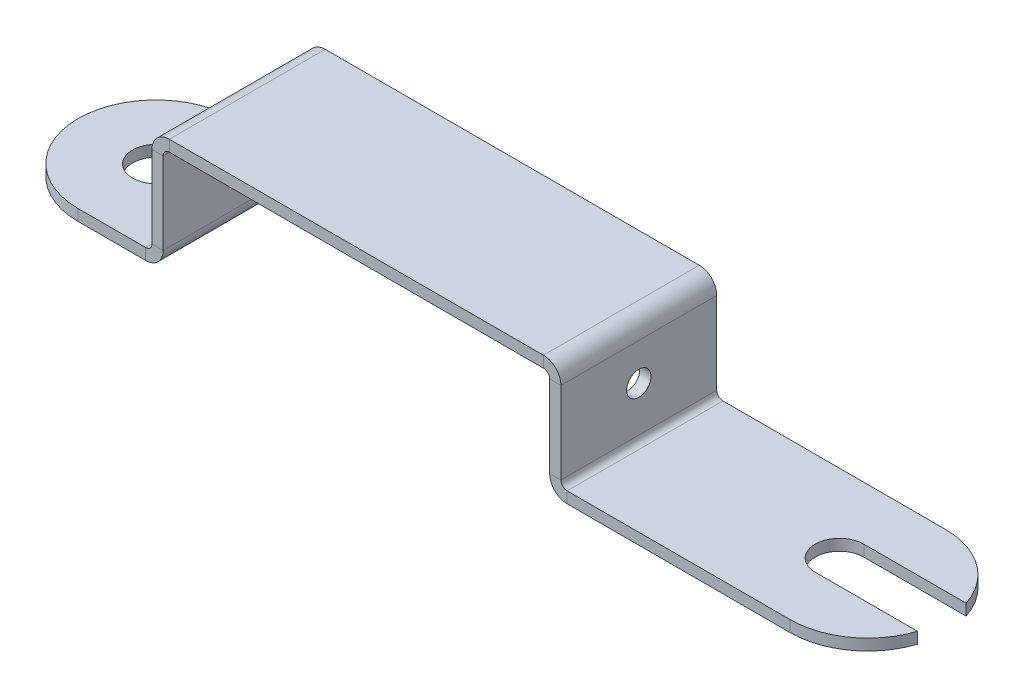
ISO-10303-21;
HEADER;
FILE_DESCRIPTION(('STEP AP214'),'2;1');
FILE_NAME('part.step','',(''),(''),'','','');
FILE_SCHEMA(('AUTOMOTIVE_DESIGN { 1 0 10303 214 1 1 1 1 }'));
ENDSEC;
DATA;
#1=APPLICATION_CONTEXT('core data for automotive mechanical design processes');
#2=APPLICATION_PROTOCOL_DEFINITION('international standard','automotive_design',2000,#1);
#3=PRODUCT_CONTEXT('',#1,'mechanical');
#4=PRODUCT('Part','Part','',(#3));
#5=PRODUCT_RELATED_PRODUCT_CATEGORY('part','',(#4));
#6=PRODUCT_DEFINITION_FORMATION('','',#4);
#7=PRODUCT_DEFINITION_CONTEXT('part definition',#1,'design');
#8=PRODUCT_DEFINITION('design','',#6,#7);
#9=PRODUCT_DEFINITION_SHAPE('','',#8);
#10=(LENGTH_UNIT() NAMED_UNIT(*) SI_UNIT(.MILLI.,.METRE.));
#11=(NAMED_UNIT(*) PLANE_ANGLE_UNIT() SI_UNIT($,.RADIAN.));
#12=(NAMED_UNIT(*) SI_UNIT($,.STERADIAN.) SOLID_ANGLE_UNIT());
#13=UNCERTAINTY_MEASURE_WITH_UNIT(LENGTH_MEASURE(1.E-05),#10,'distance_accuracy_value','');
#14=(GEOMETRIC_REPRESENTATION_CONTEXT(3) GLOBAL_UNCERTAINTY_ASSIGNED_CONTEXT((#13)) GLOBAL_UNIT_ASSIGNED_CONTEXT((#10,
#11,#12)) REPRESENTATION_CONTEXT('',''));
#15=CARTESIAN_POINT('',(0.,0.,0.));
#16=DIRECTION('',(0.,0.,1.));
#17=DIRECTION('',(1.,0.,0.));
#18=AXIS2_PLACEMENT_3D('',#15,#16,#17);
#19=CARTESIAN_POINT('',(5.9436,0.508,6.35));
#20=DIRECTION('',(0.,0.,1.));
#21=DIRECTION('',(1.,0.,0.));
#22=AXIS2_PLACEMENT_3D('',#19,#20,#21);
#23=PLANE('',#22);
#24=DIRECTION('',(1.,0.,0.));
#25=VECTOR('',#24,1.);
#26=CARTESIAN_POINT('',(5.9436,0.508,6.35));
#27=LINE('',#26,#25);
#28=CARTESIAN_POINT('',(5.9436,0.508,6.35));
#29=VERTEX_POINT('',#28);
#30=CARTESIAN_POINT('',(6.858,0.508,6.35));
#31=VERTEX_POINT('',#30);
#32=EDGE_CURVE('E429',#29,#31,#27,.T.);
#33=ORIENTED_EDGE('',*,*,#32,.F.);
#34=CARTESIAN_POINT('',(5.4356,0.508,6.35));
#35=DIRECTION('',(0.,0.,-1.));
#36=DIRECTION('',(-1.,0.,0.));
#37=AXIS2_PLACEMENT_3D('',#34,#35,#36);
#38=CIRCLE('',#37,0.508);
#39=CARTESIAN_POINT('',(5.4356,0.,6.35));
#40=VERTEX_POINT('',#39);
#41=EDGE_CURVE('E270',#40,#29,#38,.F.);
#42=ORIENTED_EDGE('',*,*,#41,.F.);
#43=DIRECTION('',(0.,1.,0.));
#44=VECTOR('',#43,1.);
#45=CARTESIAN_POINT('',(5.4356,-0.9144,6.35));
#46=LINE('',#45,#44);
#47=CARTESIAN_POINT('',(5.4356,-0.9144,6.35));
#48=VERTEX_POINT('',#47);
#49=EDGE_CURVE('E426',#48,#40,#46,.T.);
#50=ORIENTED_EDGE('',*,*,#49,.F.);
#51=CARTESIAN_POINT('',(5.4356,0.508,6.35));
#52=DIRECTION('',(0.,0.,1.));
#53=DIRECTION('',(1.,0.,0.));
#54=AXIS2_PLACEMENT_3D('',#51,#52,#53);
#55=CIRCLE('',#54,1.4224);
#56=EDGE_CURVE('E277',#48,#31,#55,.T.);
#57=ORIENTED_EDGE('',*,*,#56,.T.);
#58=EDGE_LOOP('',(#33,#42,#50,#57));
#59=FACE_BOUND('',#58,.T.);
#60=ADVANCED_FACE('F37',(#59),#23,.T.);
#61=CARTESIAN_POINT('',(5.4356,-0.9144,6.35));
#62=DIRECTION('',(0.,0.,1.));
#63=DIRECTION('',(1.,0.,0.));
#64=AXIS2_PLACEMENT_3D('',#61,#62,#63);
#65=PLANE('',#64);
#66=DIRECTION('',(0.,1.,0.));
#67=VECTOR('',#66,1.);
#68=CARTESIAN_POINT('',(5.9436,0.,6.35));
#69=LINE('',#68,#67);
#70=CARTESIAN_POINT('',(5.9436,7.1882,6.35));
#71=VERTEX_POINT('',#70);
#72=EDGE_CURVE('E267',#29,#71,#69,.T.);
#73=ORIENTED_EDGE('',*,*,#72,.F.);
#74=ORIENTED_EDGE('',*,*,#32,.T.);
#75=DIRECTION('',(0.,1.,0.));
#76=VECTOR('',#75,1.);
#77=CARTESIAN_POINT('',(6.858,0.,6.35));
#78=LINE('',#77,#76);
#79=CARTESIAN_POINT('',(6.858,7.1882,6.35));
#80=VERTEX_POINT('',#79);
#81=EDGE_CURVE('E280',#31,#80,#78,.T.);
#82=ORIENTED_EDGE('',*,*,#81,.T.);
#83=DIRECTION('',(-1.,0.,0.));
#84=VECTOR('',#83,1.);
#85=CARTESIAN_POINT('',(6.858,7.1882,6.35));
#86=LINE('',#85,#84);
#87=EDGE_CURVE('E417',#80,#71,#86,.T.);
#88=ORIENTED_EDGE('',*,*,#87,.T.);
#89=EDGE_LOOP('',(#73,#74,#82,#88));
#90=FACE_BOUND('',#89,.T.);
#91=ADVANCED_FACE('F503',(#90),#65,.T.);
#92=CARTESIAN_POINT('',(5.4356,0.,-6.35));
#93=DIRECTION('',(0.,0.,-1.));
#94=DIRECTION('',(-1.,0.,0.));
#95=AXIS2_PLACEMENT_3D('',#92,#93,#94);
#96=PLANE('',#95);
#97=DIRECTION('',(0.,-1.,0.));
#98=VECTOR('',#97,1.);
#99=CARTESIAN_POINT('',(5.4356,0.,-6.35));
#100=LINE('',#99,#98);
#101=CARTESIAN_POINT('',(5.4356,0.,-6.35));
#102=VERTEX_POINT('',#101);
#103=CARTESIAN_POINT('',(5.4356,-0.9144,-6.35));
#104=VERTEX_POINT('',#103);
#105=EDGE_CURVE('E423',#102,#104,#100,.T.);
#106=ORIENTED_EDGE('',*,*,#105,.F.);
#107=CARTESIAN_POINT('',(5.4356,0.508,-6.35));
#108=DIRECTION('',(0.,0.,-1.));
#109=DIRECTION('',(-1.,0.,0.));
#110=AXIS2_PLACEMENT_3D('',#107,#108,#109);
#111=CIRCLE('',#110,0.508);
#112=CARTESIAN_POINT('',(5.9436,0.508,-6.35));
#113=VERTEX_POINT('',#112);
#114=EDGE_CURVE('E323',#102,#113,#111,.F.);
#115=ORIENTED_EDGE('',*,*,#114,.T.);
#116=DIRECTION('',(-1.,0.,0.));
#117=VECTOR('',#116,1.);
#118=CARTESIAN_POINT('',(6.858,0.508,-6.35));
#119=LINE('',#118,#117);
#120=CARTESIAN_POINT('',(6.858,0.508,-6.35));
#121=VERTEX_POINT('',#120);
#122=EDGE_CURVE('E421',#121,#113,#119,.T.);
#123=ORIENTED_EDGE('',*,*,#122,.F.);
#124=CARTESIAN_POINT('',(5.4356,0.508,-6.35));
#125=DIRECTION('',(0.,0.,1.));
#126=DIRECTION('',(1.,0.,0.));
#127=AXIS2_PLACEMENT_3D('',#124,#125,#126);
#128=CIRCLE('',#127,1.4224);
#129=EDGE_CURVE('E330',#104,#121,#128,.T.);
#130=ORIENTED_EDGE('',*,*,#129,.F.);
#131=EDGE_LOOP('',(#106,#115,#123,#130));
#132=FACE_BOUND('',#131,.T.);
#133=ADVANCED_FACE('F509',(#132),#96,.T.);
#134=CARTESIAN_POINT('',(6.858,0.508,-6.35));
#135=DIRECTION('',(0.,0.,-1.));
#136=DIRECTION('',(-1.,0.,0.));
#137=AXIS2_PLACEMENT_3D('',#134,#135,#136);
#138=PLANE('',#137);
#139=DIRECTION('',(1.,0.,0.));
#140=VECTOR('',#139,1.);
#141=CARTESIAN_POINT('',(-6.4262,-0.9144,-6.35));
#142=LINE('',#141,#140);
#143=CARTESIAN_POINT('',(-0.0762000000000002,-0.9144,-6.35));
#144=VERTEX_POINT('',#143);
#145=EDGE_CURVE('E328',#144,#104,#142,.T.);
#146=ORIENTED_EDGE('',*,*,#145,.F.);
#147=DIRECTION('',(0.,1.,0.));
#148=VECTOR('',#147,1.);
#149=CARTESIAN_POINT('',(-0.0762000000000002,0.508,-6.35));
#150=LINE('',#149,#148);
#151=CARTESIAN_POINT('',(-0.0762000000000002,0.,-6.35));
#152=VERTEX_POINT('',#151);
#153=EDGE_CURVE('E445',#144,#152,#150,.T.);
#154=ORIENTED_EDGE('',*,*,#153,.T.);
#155=DIRECTION('',(1.,0.,0.));
#156=VECTOR('',#155,1.);
#157=CARTESIAN_POINT('',(-6.4262,0.,-6.35));
#158=LINE('',#157,#156);
#159=EDGE_CURVE('E326',#152,#102,#158,.T.);
#160=ORIENTED_EDGE('',*,*,#159,.T.);
#161=ORIENTED_EDGE('',*,*,#105,.T.);
#162=EDGE_LOOP('',(#146,#154,#160,#161));
#163=FACE_BOUND('',#162,.T.);
#164=ADVANCED_FACE('F515',(#163),#138,.T.);
#165=CARTESIAN_POINT('',(7.366,8.6106,6.35));
#166=DIRECTION('',(0.,0.,1.));
#167=DIRECTION('',(1.,0.,0.));
#168=AXIS2_PLACEMENT_3D('',#165,#166,#167);
#169=PLANE('',#168);
#170=DIRECTION('',(0.,-1.,0.));
#171=VECTOR('',#170,1.);
#172=CARTESIAN_POINT('',(7.366,8.6106,6.35));
#173=LINE('',#172,#171);
#174=CARTESIAN_POINT('',(7.366,8.6106,6.35));
#175=VERTEX_POINT('',#174);
#176=CARTESIAN_POINT('',(7.366,7.6962,6.35));
#177=VERTEX_POINT('',#176);
#178=EDGE_CURVE('E419',#175,#177,#173,.T.);
#179=ORIENTED_EDGE('',*,*,#178,.F.);
#180=CARTESIAN_POINT('',(7.366,7.1882,6.35));
#181=DIRECTION('',(0.,0.,1.));
#182=DIRECTION('',(1.,0.,0.));
#183=AXIS2_PLACEMENT_3D('',#180,#181,#182);
#184=CIRCLE('',#183,1.4224);
#185=EDGE_CURVE('E264',#71,#175,#184,.F.);
#186=ORIENTED_EDGE('',*,*,#185,.F.);
#187=ORIENTED_EDGE('',*,*,#87,.F.);
#188=CARTESIAN_POINT('',(7.366,7.1882,6.35));
#189=DIRECTION('',(0.,0.,1.));
#190=DIRECTION('',(1.,0.,0.));
#191=AXIS2_PLACEMENT_3D('',#188,#189,#190);
#192=CIRCLE('',#191,0.508);
#193=EDGE_CURVE('E283',#80,#177,#192,.F.);
#194=ORIENTED_EDGE('',*,*,#193,.T.);
#195=EDGE_LOOP('',(#179,#186,#187,#194));
#196=FACE_BOUND('',#195,.T.);
#197=ADVANCED_FACE('F519',(#196),#169,.T.);
#198=CARTESIAN_POINT('',(6.858,7.1882,6.35));
#199=DIRECTION('',(0.,0.,1.));
#200=DIRECTION('',(1.,0.,0.));
#201=AXIS2_PLACEMENT_3D('',#198,#199,#200);
#202=PLANE('',#201);
#203=DIRECTION('',(1.,0.,0.));
#204=VECTOR('',#203,1.);
#205=CARTESIAN_POINT('',(5.9436,8.6106,6.35));
#206=LINE('',#205,#204);
#207=CARTESIAN_POINT('',(37.8587,8.6106,6.35));
#208=VERTEX_POINT('',#207);
#209=EDGE_CURVE('E261',#175,#208,#206,.T.);
#210=ORIENTED_EDGE('',*,*,#209,.F.);
#211=ORIENTED_EDGE('',*,*,#178,.T.);
#212=DIRECTION('',(1.,0.,0.));
#213=VECTOR('',#212,1.);
#214=CARTESIAN_POINT('',(5.9436,7.6962,6.35));
#215=LINE('',#214,#213);
#216=CARTESIAN_POINT('',(37.8587,7.6962,6.35));
#217=VERTEX_POINT('',#216);
#218=EDGE_CURVE('E286',#177,#217,#215,.T.);
#219=ORIENTED_EDGE('',*,*,#218,.T.);
#220=DIRECTION('',(0.,1.,0.));
#221=VECTOR('',#220,1.);
#222=CARTESIAN_POINT('',(37.8587,7.6962,6.35));
#223=LINE('',#222,#221);
#224=EDGE_CURVE('E409',#217,#208,#223,.T.);
#225=ORIENTED_EDGE('',*,*,#224,.T.);
#226=EDGE_LOOP('',(#210,#211,#219,#225));
#227=FACE_BOUND('',#226,.T.);
#228=ADVANCED_FACE('F523',(#227),#202,.T.);
#229=CARTESIAN_POINT('',(5.9436,7.1882,-6.35));
#230=DIRECTION('',(0.,0.,-1.));
#231=DIRECTION('',(-1.,0.,0.));
#232=AXIS2_PLACEMENT_3D('',#229,#230,#231);
#233=PLANE('',#232);
#234=DIRECTION('',(1.,0.,0.));
#235=VECTOR('',#234,1.);
#236=CARTESIAN_POINT('',(5.9436,7.1882,-6.35));
#237=LINE('',#236,#235);
#238=CARTESIAN_POINT('',(5.9436,7.1882,-6.35));
#239=VERTEX_POINT('',#238);
#240=CARTESIAN_POINT('',(6.858,7.1882,-6.35));
#241=VERTEX_POINT('',#240);
#242=EDGE_CURVE('E415',#239,#241,#237,.T.);
#243=ORIENTED_EDGE('',*,*,#242,.F.);
#244=CARTESIAN_POINT('',(7.366,7.1882,-6.35));
#245=DIRECTION('',(0.,0.,1.));
#246=DIRECTION('',(1.,0.,0.));
#247=AXIS2_PLACEMENT_3D('',#244,#245,#246);
#248=CIRCLE('',#247,1.4224);
#249=CARTESIAN_POINT('',(7.366,8.6106,-6.35));
#250=VERTEX_POINT('',#249);
#251=EDGE_CURVE('E317',#239,#250,#248,.F.);
#252=ORIENTED_EDGE('',*,*,#251,.T.);
#253=DIRECTION('',(0.,1.,0.));
#254=VECTOR('',#253,1.);
#255=CARTESIAN_POINT('',(7.366,7.6962,-6.35));
#256=LINE('',#255,#254);
#257=CARTESIAN_POINT('',(7.366,7.6962,-6.35));
#258=VERTEX_POINT('',#257);
#259=EDGE_CURVE('E413',#258,#250,#256,.T.);
#260=ORIENTED_EDGE('',*,*,#259,.F.);
#261=CARTESIAN_POINT('',(7.366,7.1882,-6.35));
#262=DIRECTION('',(0.,0.,1.));
#263=DIRECTION('',(1.,0.,0.));
#264=AXIS2_PLACEMENT_3D('',#261,#262,#263);
#265=CIRCLE('',#264,0.508);
#266=EDGE_CURVE('E336',#241,#258,#265,.F.);
#267=ORIENTED_EDGE('',*,*,#266,.F.);
#268=EDGE_LOOP('',(#243,#252,#260,#267));
#269=FACE_BOUND('',#268,.T.);
#270=ADVANCED_FACE('F527',(#269),#233,.T.);
#271=CARTESIAN_POINT('',(7.366,7.6962,-6.35));
#272=DIRECTION('',(0.,0.,-1.));
#273=DIRECTION('',(-1.,0.,0.));
#274=AXIS2_PLACEMENT_3D('',#271,#272,#273);
#275=PLANE('',#274);
#276=DIRECTION('',(0.,1.,0.));
#277=VECTOR('',#276,1.);
#278=CARTESIAN_POINT('',(5.9436,0.,-6.35));
#279=LINE('',#278,#277);
#280=EDGE_CURVE('E320',#113,#239,#279,.T.);
#281=ORIENTED_EDGE('',*,*,#280,.T.);
#282=ORIENTED_EDGE('',*,*,#242,.T.);
#283=DIRECTION('',(0.,1.,0.));
#284=VECTOR('',#283,1.);
#285=CARTESIAN_POINT('',(6.858,0.,-6.35));
#286=LINE('',#285,#284);
#287=EDGE_CURVE('E333',#121,#241,#286,.T.);
#288=ORIENTED_EDGE('',*,*,#287,.F.);
#289=ORIENTED_EDGE('',*,*,#122,.T.);
#290=EDGE_LOOP('',(#281,#282,#288,#289));
#291=FACE_BOUND('',#290,.T.);
#292=ADVANCED_FACE('F531',(#291),#275,.T.);
#293=CARTESIAN_POINT('',(39.2811,7.1882,6.35));
#294=DIRECTION('',(0.,0.,1.));
#295=DIRECTION('',(1.,0.,0.));
#296=AXIS2_PLACEMENT_3D('',#293,#294,#295);
#297=PLANE('',#296);
#298=DIRECTION('',(-1.,0.,0.));
#299=VECTOR('',#298,1.);
#300=CARTESIAN_POINT('',(39.2811,7.1882,6.35));
#301=LINE('',#300,#299);
#302=CARTESIAN_POINT('',(39.2811,7.1882,6.35));
#303=VERTEX_POINT('',#302);
#304=CARTESIAN_POINT('',(38.3667,7.1882,6.35));
#305=VERTEX_POINT('',#304);
#306=EDGE_CURVE('E411',#303,#305,#301,.T.);
#307=ORIENTED_EDGE('',*,*,#306,.F.);
#308=CARTESIAN_POINT('',(37.8587,7.1882,6.35));
#309=DIRECTION('',(0.,0.,1.));
#310=DIRECTION('',(1.,0.,0.));
#311=AXIS2_PLACEMENT_3D('',#308,#309,#310);
#312=CIRCLE('',#311,1.4224);
#313=EDGE_CURVE('E258',#208,#303,#312,.F.);
#314=ORIENTED_EDGE('',*,*,#313,.F.);
#315=ORIENTED_EDGE('',*,*,#224,.F.);
#316=CARTESIAN_POINT('',(37.8587,7.1882,6.35));
#317=DIRECTION('',(0.,0.,1.));
#318=DIRECTION('',(1.,0.,0.));
#319=AXIS2_PLACEMENT_3D('',#316,#317,#318);
#320=CIRCLE('',#319,0.508);
#321=EDGE_CURVE('E289',#217,#305,#320,.F.);
#322=ORIENTED_EDGE('',*,*,#321,.T.);
#323=EDGE_LOOP('',(#307,#314,#315,#322));
#324=FACE_BOUND('',#323,.T.);
#325=ADVANCED_FACE('F535',(#324),#297,.T.);
#326=CARTESIAN_POINT('',(37.8587,7.6962,6.35));
#327=DIRECTION('',(0.,0.,1.));
#328=DIRECTION('',(1.,0.,0.));
#329=AXIS2_PLACEMENT_3D('',#326,#327,#328);
#330=PLANE('',#329);
#331=DIRECTION('',(0.,-1.,0.));
#332=VECTOR('',#331,1.);
#333=CARTESIAN_POINT('',(39.2811,8.6106,6.35));
#334=LINE('',#333,#332);
#335=CARTESIAN_POINT('',(39.2811,0.508,6.35));
#336=VERTEX_POINT('',#335);
#337=EDGE_CURVE('E255',#303,#336,#334,.T.);
#338=ORIENTED_EDGE('',*,*,#337,.F.);
#339=ORIENTED_EDGE('',*,*,#306,.T.);
#340=DIRECTION('',(0.,1.,0.));
#341=VECTOR('',#340,1.);
#342=CARTESIAN_POINT('',(38.3667,8.6106,6.35));
#343=LINE('',#342,#341);
#344=CARTESIAN_POINT('',(38.3667,0.508,6.35));
#345=VERTEX_POINT('',#344);
#346=EDGE_CURVE('E292',#305,#345,#343,.F.);
#347=ORIENTED_EDGE('',*,*,#346,.T.);
#348=DIRECTION('',(1.,0.,0.));
#349=VECTOR('',#348,1.);
#350=CARTESIAN_POINT('',(38.3667,0.508,6.35));
#351=LINE('',#350,#349);
#352=EDGE_CURVE('E401',#345,#336,#351,.T.);
#353=ORIENTED_EDGE('',*,*,#352,.T.);
#354=EDGE_LOOP('',(#338,#339,#347,#353));
#355=FACE_BOUND('',#354,.T.);
#356=ADVANCED_FACE('F539',(#355),#330,.T.);
#357=CARTESIAN_POINT('',(37.8587,8.6106,-6.35));
#358=DIRECTION('',(0.,0.,-1.));
#359=DIRECTION('',(-1.,0.,0.));
#360=AXIS2_PLACEMENT_3D('',#357,#358,#359);
#361=PLANE('',#360);
#362=DIRECTION('',(0.,-1.,0.));
#363=VECTOR('',#362,1.);
#364=CARTESIAN_POINT('',(37.8587,8.6106,-6.35));
#365=LINE('',#364,#363);
#366=CARTESIAN_POINT('',(37.8587,8.6106,-6.35));
#367=VERTEX_POINT('',#366);
#368=CARTESIAN_POINT('',(37.8587,7.6962,-6.35));
#369=VERTEX_POINT('',#368);
#370=EDGE_CURVE('E407',#367,#369,#365,.T.);
#371=ORIENTED_EDGE('',*,*,#370,.F.);
#372=CARTESIAN_POINT('',(37.8587,7.1882,-6.35));
#373=DIRECTION('',(0.,0.,1.));
#374=DIRECTION('',(1.,0.,0.));
#375=AXIS2_PLACEMENT_3D('',#372,#373,#374);
#376=CIRCLE('',#375,1.4224);
#377=CARTESIAN_POINT('',(39.2811,7.1882,-6.35));
#378=VERTEX_POINT('',#377);
#379=EDGE_CURVE('E311',#367,#378,#376,.F.);
#380=ORIENTED_EDGE('',*,*,#379,.T.);
#381=DIRECTION('',(1.,0.,0.));
#382=VECTOR('',#381,1.);
#383=CARTESIAN_POINT('',(38.3667,7.1882,-6.35));
#384=LINE('',#383,#382);
#385=CARTESIAN_POINT('',(38.3667,7.1882,-6.35));
#386=VERTEX_POINT('',#385);
#387=EDGE_CURVE('E405',#386,#378,#384,.T.);
#388=ORIENTED_EDGE('',*,*,#387,.F.);
#389=CARTESIAN_POINT('',(37.8587,7.1882,-6.35));
#390=DIRECTION('',(0.,0.,1.));
#391=DIRECTION('',(1.,0.,0.));
#392=AXIS2_PLACEMENT_3D('',#389,#390,#391);
#393=CIRCLE('',#392,0.508);
#394=EDGE_CURVE('E342',#369,#386,#393,.F.);
#395=ORIENTED_EDGE('',*,*,#394,.F.);
#396=EDGE_LOOP('',(#371,#380,#388,#395));
#397=FACE_BOUND('',#396,.T.);
#398=ADVANCED_FACE('F543',(#397),#361,.T.);
#399=CARTESIAN_POINT('',(38.3667,7.1882,-6.35));
#400=DIRECTION('',(0.,0.,-1.));
#401=DIRECTION('',(-1.,0.,0.));
#402=AXIS2_PLACEMENT_3D('',#399,#400,#401);
#403=PLANE('',#402);
#404=DIRECTION('',(1.,0.,0.));
#405=VECTOR('',#404,1.);
#406=CARTESIAN_POINT('',(5.9436,8.6106,-6.35));
#407=LINE('',#406,#405);
#408=EDGE_CURVE('E314',#250,#367,#407,.T.);
#409=ORIENTED_EDGE('',*,*,#408,.T.);
#410=ORIENTED_EDGE('',*,*,#370,.T.);
#411=DIRECTION('',(1.,0.,0.));
#412=VECTOR('',#411,1.);
#413=CARTESIAN_POINT('',(5.9436,7.6962,-6.35));
#414=LINE('',#413,#412);
#415=EDGE_CURVE('E339',#258,#369,#414,.T.);
#416=ORIENTED_EDGE('',*,*,#415,.F.);
#417=ORIENTED_EDGE('',*,*,#259,.T.);
#418=EDGE_LOOP('',(#409,#410,#416,#417));
#419=FACE_BOUND('',#418,.T.);
#420=ADVANCED_FACE('F547',(#419),#403,.T.);
#421=CARTESIAN_POINT('',(39.7891,0.,6.35));
#422=DIRECTION('',(0.,0.,1.));
#423=DIRECTION('',(1.,0.,0.));
#424=AXIS2_PLACEMENT_3D('',#421,#422,#423);
#425=PLANE('',#424);
#426=DIRECTION('',(0.,-1.,0.));
#427=VECTOR('',#426,1.);
#428=CARTESIAN_POINT('',(39.7891,0.,6.35));
#429=LINE('',#428,#427);
#430=CARTESIAN_POINT('',(39.7891,0.,6.35));
#431=VERTEX_POINT('',#430);
#432=CARTESIAN_POINT('',(39.7891,-0.9144,6.35));
#433=VERTEX_POINT('',#432);
#434=EDGE_CURVE('E403',#431,#433,#429,.T.);
#435=ORIENTED_EDGE('',*,*,#434,.F.);
#436=CARTESIAN_POINT('',(39.7891,0.508,6.35));
#437=DIRECTION('',(0.,0.,-1.));
#438=DIRECTION('',(-1.,0.,0.));
#439=AXIS2_PLACEMENT_3D('',#436,#437,#438);
#440=CIRCLE('',#439,0.508);
#441=EDGE_CURVE('E252',#336,#431,#440,.F.);
#442=ORIENTED_EDGE('',*,*,#441,.F.);
#443=ORIENTED_EDGE('',*,*,#352,.F.);
#444=CARTESIAN_POINT('',(39.7891,0.508,6.35));
#445=DIRECTION('',(0.,0.,1.));
#446=DIRECTION('',(1.,0.,0.));
#447=AXIS2_PLACEMENT_3D('',#444,#445,#446);
#448=CIRCLE('',#447,1.4224);
#449=EDGE_CURVE('E295',#345,#433,#448,.T.);
#450=ORIENTED_EDGE('',*,*,#449,.T.);
#451=EDGE_LOOP('',(#435,#442,#443,#450));
#452=FACE_BOUND('',#451,.T.);
#453=ADVANCED_FACE('F551',(#452),#425,.T.);
#454=CARTESIAN_POINT('',(38.3667,0.508,6.35));
#455=DIRECTION('',(0.,0.,1.));
#456=DIRECTION('',(1.,0.,0.));
#457=AXIS2_PLACEMENT_3D('',#454,#455,#456);
#458=PLANE('',#457);
#459=DIRECTION('',(1.,0.,0.));
#460=VECTOR('',#459,1.);
#461=CARTESIAN_POINT('',(39.2811,-0.9144,6.35));
#462=LINE('',#461,#460);
#463=CARTESIAN_POINT('',(57.9501,-0.9144,6.35));
#464=VERTEX_POINT('',#463);
#465=EDGE_CURVE('E245',#433,#464,#462,.T.);
#466=ORIENTED_EDGE('',*,*,#465,.T.);
#467=DIRECTION('',(0.,-1.,0.));
#468=VECTOR('',#467,1.);
#469=CARTESIAN_POINT('',(57.9501,0.508,6.35));
#470=LINE('',#469,#468);
#471=CARTESIAN_POINT('',(57.9501,0.,6.35));
#472=VERTEX_POINT('',#471);
#473=EDGE_CURVE('E443',#464,#472,#470,.F.);
#474=ORIENTED_EDGE('',*,*,#473,.T.);
#475=DIRECTION('',(1.,0.,0.));
#476=VECTOR('',#475,1.);
#477=CARTESIAN_POINT('',(39.2811,0.,6.35));
#478=LINE('',#477,#476);
#479=EDGE_CURVE('E248',#431,#472,#478,.T.);
#480=ORIENTED_EDGE('',*,*,#479,.F.);
#481=ORIENTED_EDGE('',*,*,#434,.T.);
#482=EDGE_LOOP('',(#466,#474,#480,#481));
#483=FACE_BOUND('',#482,.T.);
#484=ADVANCED_FACE('F489',(#483),#458,.T.);
#485=CARTESIAN_POINT('',(39.2811,0.508,-6.35));
#486=DIRECTION('',(0.,0.,-1.));
#487=DIRECTION('',(-1.,0.,0.));
#488=AXIS2_PLACEMENT_3D('',#485,#486,#487);
#489=PLANE('',#488);
#490=DIRECTION('',(-1.,0.,0.));
#491=VECTOR('',#490,1.);
#492=CARTESIAN_POINT('',(39.2811,0.508,-6.35));
#493=LINE('',#492,#491);
#494=CARTESIAN_POINT('',(39.2811,0.508,-6.35));
#495=VERTEX_POINT('',#494);
#496=CARTESIAN_POINT('',(38.3667,0.508,-6.35));
#497=VERTEX_POINT('',#496);
#498=EDGE_CURVE('E399',#495,#497,#493,.T.);
#499=ORIENTED_EDGE('',*,*,#498,.F.);
#500=CARTESIAN_POINT('',(39.7891,0.508,-6.35));
#501=DIRECTION('',(0.,0.,-1.));
#502=DIRECTION('',(-1.,0.,0.));
#503=AXIS2_PLACEMENT_3D('',#500,#501,#502);
#504=CIRCLE('',#503,0.508);
#505=CARTESIAN_POINT('',(39.7891,0.,-6.35));
#506=VERTEX_POINT('',#505);
#507=EDGE_CURVE('E305',#495,#506,#504,.F.);
#508=ORIENTED_EDGE('',*,*,#507,.T.);
#509=DIRECTION('',(0.,1.,0.));
#510=VECTOR('',#509,1.);
#511=CARTESIAN_POINT('',(39.7891,-0.9144,-6.35));
#512=LINE('',#511,#510);
#513=CARTESIAN_POINT('',(39.7891,-0.9144,-6.35));
#514=VERTEX_POINT('',#513);
#515=EDGE_CURVE('E397',#514,#506,#512,.T.);
#516=ORIENTED_EDGE('',*,*,#515,.F.);
#517=CARTESIAN_POINT('',(39.7891,0.508,-6.35));
#518=DIRECTION('',(0.,0.,1.));
#519=DIRECTION('',(1.,0.,0.));
#520=AXIS2_PLACEMENT_3D('',#517,#518,#519);
#521=CIRCLE('',#520,1.4224);
#522=EDGE_CURVE('E249',#497,#514,#521,.T.);
#523=ORIENTED_EDGE('',*,*,#522,.F.);
#524=EDGE_LOOP('',(#499,#508,#516,#523));
#525=FACE_BOUND('',#524,.T.);
#526=ADVANCED_FACE('F479',(#525),#489,.T.);
#527=CARTESIAN_POINT('',(39.7891,-0.9144,-6.35));
#528=DIRECTION('',(0.,0.,-1.));
#529=DIRECTION('',(-1.,0.,0.));
#530=AXIS2_PLACEMENT_3D('',#527,#528,#529);
#531=PLANE('',#530);
#532=DIRECTION('',(0.,-1.,0.));
#533=VECTOR('',#532,1.);
#534=CARTESIAN_POINT('',(39.2811,8.6106,-6.35));
#535=LINE('',#534,#533);
#536=EDGE_CURVE('E308',#378,#495,#535,.T.);
#537=ORIENTED_EDGE('',*,*,#536,.T.);
#538=ORIENTED_EDGE('',*,*,#498,.T.);
#539=DIRECTION('',(0.,1.,0.));
#540=VECTOR('',#539,1.);
#541=CARTESIAN_POINT('',(38.3667,8.6106,-6.35));
#542=LINE('',#541,#540);
#543=EDGE_CURVE('E345',#386,#497,#542,.F.);
#544=ORIENTED_EDGE('',*,*,#543,.F.);
#545=ORIENTED_EDGE('',*,*,#387,.T.);
#546=EDGE_LOOP('',(#537,#538,#544,#545));
#547=FACE_BOUND('',#546,.T.);
#548=ADVANCED_FACE('F560',(#547),#531,.T.);
#549=CARTESIAN_POINT('',(39.2811,-0.9144,6.35));
#550=DIRECTION('',(0.,1.,0.));
#551=DIRECTION('',(0.,0.,1.));
#552=AXIS2_PLACEMENT_3D('',#549,#550,#551);
#553=PLANE('',#552);
#554=CARTESIAN_POINT('',(57.9501,-0.9144,0.));
#555=DIRECTION('',(0.,1.,0.));
#556=DIRECTION('',(0.,0.,1.));
#557=AXIS2_PLACEMENT_3D('',#554,#555,#556);
#558=CIRCLE('',#557,6.35);
#559=CARTESIAN_POINT('',(57.9501,-0.9144,-6.35));
#560=VERTEX_POINT('',#559);
#561=CARTESIAN_POINT('',(63.9831213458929,-0.9144,-1.9812));
#562=VERTEX_POINT('',#561);
#563=EDGE_CURVE('E436',#560,#562,#558,.F.);
#564=ORIENTED_EDGE('',*,*,#563,.T.);
#565=DIRECTION('',(-1.,0.,0.));
#566=VECTOR('',#565,1.);
#567=CARTESIAN_POINT('',(55.6387,-0.9144,-1.9812));
#568=LINE('',#567,#566);
#569=CARTESIAN_POINT('',(55.6387,-0.9144,-1.9812));
#570=VERTEX_POINT('',#569);
#571=EDGE_CURVE('E53',#562,#570,#568,.T.);
#572=ORIENTED_EDGE('',*,*,#571,.T.);
#573=CARTESIAN_POINT('',(55.6387,-0.9144,0.));
#574=DIRECTION('',(0.,1.,0.));
#575=DIRECTION('',(0.,0.,1.));
#576=AXIS2_PLACEMENT_3D('',#573,#574,#575);
#577=CIRCLE('',#576,1.9812);
#578=CARTESIAN_POINT('',(55.6387,-0.9144,1.9812));
#579=VERTEX_POINT('',#578);
#580=EDGE_CURVE('E210',#570,#579,#577,.T.);
#581=ORIENTED_EDGE('',*,*,#580,.T.);
#582=DIRECTION('',(1.,0.,0.));
#583=VECTOR('',#582,1.);
#584=CARTESIAN_POINT('',(55.6387,-0.9144,1.9812));
#585=LINE('',#584,#583);
#586=CARTESIAN_POINT('',(63.9831213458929,-0.9144,1.9812));
#587=VERTEX_POINT('',#586);
#588=EDGE_CURVE('E218',#579,#587,#585,.T.);
#589=ORIENTED_EDGE('',*,*,#588,.T.);
#590=CARTESIAN_POINT('',(57.9501,-0.9144,0.));
#591=DIRECTION('',(0.,1.,0.));
#592=DIRECTION('',(0.,0.,1.));
#593=AXIS2_PLACEMENT_3D('',#590,#591,#592);
#594=CIRCLE('',#593,6.35);
#595=EDGE_CURVE('E434',#587,#464,#594,.F.);
#596=ORIENTED_EDGE('',*,*,#595,.T.);
#597=ORIENTED_EDGE('',*,*,#465,.F.);
#598=DIRECTION('',(0.,0.,-1.));
#599=VECTOR('',#598,1.);
#600=CARTESIAN_POINT('',(39.7891,-0.9144,6.35));
#601=LINE('',#600,#599);
#602=EDGE_CURVE('E298',#433,#514,#601,.T.);
#603=ORIENTED_EDGE('',*,*,#602,.T.);
#604=DIRECTION('',(1.,0.,0.));
#605=VECTOR('',#604,1.);
#606=CARTESIAN_POINT('',(39.2811,-0.9144,-6.35));
#607=LINE('',#606,#605);
#608=EDGE_CURVE('E299',#514,#560,#607,.T.);
#609=ORIENTED_EDGE('',*,*,#608,.T.);
#610=EDGE_LOOP('',(#564,#572,#581,#589,#596,#597,#603,#609));
#611=FACE_BOUND('',#610,.T.);
#612=ADVANCED_FACE('F225',(#611),#553,.F.);
#613=CARTESIAN_POINT('',(39.2811,0.,6.35));
#614=DIRECTION('',(0.,1.,0.));
#615=DIRECTION('',(0.,0.,1.));
#616=AXIS2_PLACEMENT_3D('',#613,#614,#615);
#617=PLANE('',#616);
#618=DIRECTION('',(-1.,0.,0.));
#619=VECTOR('',#618,1.);
#620=CARTESIAN_POINT('',(55.6387,0.,-1.9812));
#621=LINE('',#620,#619);
#622=CARTESIAN_POINT('',(63.9831213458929,0.,-1.9812));
#623=VERTEX_POINT('',#622);
#624=CARTESIAN_POINT('',(55.6387,0.,-1.9812));
#625=VERTEX_POINT('',#624);
#626=EDGE_CURVE('E226',#623,#625,#621,.T.);
#627=ORIENTED_EDGE('',*,*,#626,.F.);
#628=CARTESIAN_POINT('',(57.9501,0.,0.));
#629=DIRECTION('',(0.,1.,0.));
#630=DIRECTION('',(0.,0.,1.));
#631=AXIS2_PLACEMENT_3D('',#628,#629,#630);
#632=CIRCLE('',#631,6.35);
#633=CARTESIAN_POINT('',(57.9501,0.,-6.35));
#634=VERTEX_POINT('',#633);
#635=EDGE_CURVE('E441',#623,#634,#632,.T.);
#636=ORIENTED_EDGE('',*,*,#635,.T.);
#637=DIRECTION('',(1.,0.,0.));
#638=VECTOR('',#637,1.);
#639=CARTESIAN_POINT('',(39.2811,0.,-6.35));
#640=LINE('',#639,#638);
#641=EDGE_CURVE('E302',#506,#634,#640,.T.);
#642=ORIENTED_EDGE('',*,*,#641,.F.);
#643=DIRECTION('',(0.,0.,-1.));
#644=VECTOR('',#643,1.);
#645=CARTESIAN_POINT('',(39.7891,0.,6.35));
#646=LINE('',#645,#644);
#647=EDGE_CURVE('E394',#431,#506,#646,.T.);
#648=ORIENTED_EDGE('',*,*,#647,.F.);
#649=ORIENTED_EDGE('',*,*,#479,.T.);
#650=CARTESIAN_POINT('',(57.9501,0.,0.));
#651=DIRECTION('',(0.,1.,0.));
#652=DIRECTION('',(0.,0.,1.));
#653=AXIS2_PLACEMENT_3D('',#650,#651,#652);
#654=CIRCLE('',#653,6.35);
#655=CARTESIAN_POINT('',(63.9831213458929,0.,1.9812));
#656=VERTEX_POINT('',#655);
#657=EDGE_CURVE('E438',#472,#656,#654,.T.);
#658=ORIENTED_EDGE('',*,*,#657,.T.);
#659=DIRECTION('',(1.,0.,0.));
#660=VECTOR('',#659,1.);
#661=CARTESIAN_POINT('',(55.6387,0.,1.9812));
#662=LINE('',#661,#660);
#663=CARTESIAN_POINT('',(55.6387,0.,1.9812));
#664=VERTEX_POINT('',#663);
#665=EDGE_CURVE('E228',#664,#656,#662,.T.);
#666=ORIENTED_EDGE('',*,*,#665,.F.);
#667=CARTESIAN_POINT('',(55.6387,0.,0.));
#668=DIRECTION('',(0.,1.,0.));
#669=DIRECTION('',(0.,0.,1.));
#670=AXIS2_PLACEMENT_3D('',#667,#668,#669);
#671=CIRCLE('',#670,1.9812);
#672=EDGE_CURVE('E212',#625,#664,#671,.T.);
#673=ORIENTED_EDGE('',*,*,#672,.F.);
#674=EDGE_LOOP('',(#627,#636,#642,#648,#649,#658,#666,#673));
#675=FACE_BOUND('',#674,.T.);
#676=ADVANCED_FACE('F464',(#675),#617,.T.);
#677=CARTESIAN_POINT('',(39.7891,0.508,6.35));
#678=DIRECTION('',(0.,0.,-1.));
#679=DIRECTION('',(-1.,0.,0.));
#680=AXIS2_PLACEMENT_3D('',#677,#678,#679);
#681=CYLINDRICAL_SURFACE('',#680,0.508);
#682=ORIENTED_EDGE('',*,*,#507,.F.);
#683=DIRECTION('',(0.,0.,-1.));
#684=VECTOR('',#683,1.);
#685=CARTESIAN_POINT('',(39.2811,0.508,6.35));
#686=LINE('',#685,#684);
#687=EDGE_CURVE('E391',#336,#495,#686,.T.);
#688=ORIENTED_EDGE('',*,*,#687,.F.);
#689=ORIENTED_EDGE('',*,*,#441,.T.);
#690=ORIENTED_EDGE('',*,*,#647,.T.);
#691=EDGE_LOOP('',(#682,#688,#689,#690));
#692=FACE_BOUND('',#691,.T.);
#693=ADVANCED_FACE('F483',(#692),#681,.F.);
#694=CARTESIAN_POINT('',(39.2811,8.6106,6.35));
#695=DIRECTION('',(1.,0.,0.));
#696=DIRECTION('',(0.,0.,-1.));
#697=AXIS2_PLACEMENT_3D('',#694,#695,#696);
#698=PLANE('',#697);
#699=CARTESIAN_POINT('',(39.2811,4.1656,0.));
#700=DIRECTION('',(1.,0.,0.));
#701=DIRECTION('',(0.,0.,-1.));
#702=AXIS2_PLACEMENT_3D('',#699,#700,#701);
#703=CIRCLE('',#702,0.9906);
#704=CARTESIAN_POINT('',(39.2811,4.1656,0.9906));
#705=VERTEX_POINT('',#704);
#706=EDGE_CURVE('E231',#705,#705,#703,.T.);
#707=ORIENTED_EDGE('',*,*,#706,.F.);
#708=EDGE_LOOP('',(#707));
#709=FACE_BOUND('',#708,.T.);
#710=ORIENTED_EDGE('',*,*,#536,.F.);
#711=DIRECTION('',(0.,0.,-1.));
#712=VECTOR('',#711,1.);
#713=CARTESIAN_POINT('',(39.2811,7.1882,6.35));
#714=LINE('',#713,#712);
#715=EDGE_CURVE('E388',#303,#378,#714,.T.);
#716=ORIENTED_EDGE('',*,*,#715,.F.);
#717=ORIENTED_EDGE('',*,*,#337,.T.);
#718=ORIENTED_EDGE('',*,*,#687,.T.);
#719=EDGE_LOOP('',(#710,#716,#717,#718));
#720=FACE_BOUND('',#719,.T.);
#721=ADVANCED_FACE('F570',(#709,#720),#698,.T.);
#722=CARTESIAN_POINT('',(37.8587,7.1882,6.35));
#723=DIRECTION('',(0.,0.,-1.));
#724=DIRECTION('',(-1.,0.,0.));
#725=AXIS2_PLACEMENT_3D('',#722,#723,#724);
#726=CYLINDRICAL_SURFACE('',#725,1.4224);
#727=ORIENTED_EDGE('',*,*,#379,.F.);
#728=DIRECTION('',(0.,0.,-1.));
#729=VECTOR('',#728,1.);
#730=CARTESIAN_POINT('',(37.8587,8.6106,6.35));
#731=LINE('',#730,#729);
#732=EDGE_CURVE('E385',#208,#367,#731,.T.);
#733=ORIENTED_EDGE('',*,*,#732,.F.);
#734=ORIENTED_EDGE('',*,*,#313,.T.);
#735=ORIENTED_EDGE('',*,*,#715,.T.);
#736=EDGE_LOOP('',(#727,#733,#734,#735));
#737=FACE_BOUND('',#736,.T.);
#738=ADVANCED_FACE('F573',(#737),#726,.T.);
#739=CARTESIAN_POINT('',(5.9436,8.6106,6.35));
#740=DIRECTION('',(0.,1.,0.));
#741=DIRECTION('',(0.,0.,1.));
#742=AXIS2_PLACEMENT_3D('',#739,#740,#741);
#743=PLANE('',#742);
#744=ORIENTED_EDGE('',*,*,#408,.F.);
#745=DIRECTION('',(0.,0.,-1.));
#746=VECTOR('',#745,1.);
#747=CARTESIAN_POINT('',(7.366,8.6106,6.35));
#748=LINE('',#747,#746);
#749=EDGE_CURVE('E382',#175,#250,#748,.T.);
#750=ORIENTED_EDGE('',*,*,#749,.F.);
#751=ORIENTED_EDGE('',*,*,#209,.T.);
#752=ORIENTED_EDGE('',*,*,#732,.T.);
#753=EDGE_LOOP('',(#744,#750,#751,#752));
#754=FACE_BOUND('',#753,.T.);
#755=ADVANCED_FACE('F577',(#754),#743,.T.);
#756=CARTESIAN_POINT('',(7.366,7.1882,6.35));
#757=DIRECTION('',(0.,0.,-1.));
#758=DIRECTION('',(-1.,0.,0.));
#759=AXIS2_PLACEMENT_3D('',#756,#757,#758);
#760=CYLINDRICAL_SURFACE('',#759,1.4224);
#761=ORIENTED_EDGE('',*,*,#251,.F.);
#762=DIRECTION('',(0.,0.,-1.));
#763=VECTOR('',#762,1.);
#764=CARTESIAN_POINT('',(5.9436,7.1882,6.35));
#765=LINE('',#764,#763);
#766=EDGE_CURVE('E379',#71,#239,#765,.T.);
#767=ORIENTED_EDGE('',*,*,#766,.F.);
#768=ORIENTED_EDGE('',*,*,#185,.T.);
#769=ORIENTED_EDGE('',*,*,#749,.T.);
#770=EDGE_LOOP('',(#761,#767,#768,#769));
#771=FACE_BOUND('',#770,.T.);
#772=ADVANCED_FACE('F581',(#771),#760,.T.);
#773=CARTESIAN_POINT('',(5.9436,0.,6.35));
#774=DIRECTION('',(-1.,0.,0.));
#775=DIRECTION('',(0.,0.,1.));
#776=AXIS2_PLACEMENT_3D('',#773,#774,#775);
#777=PLANE('',#776);
#778=CARTESIAN_POINT('',(5.9436,4.1656,0.));
#779=DIRECTION('',(-1.,0.,0.));
#780=DIRECTION('',(0.,0.,1.));
#781=AXIS2_PLACEMENT_3D('',#778,#779,#780);
#782=CIRCLE('',#781,0.9906);
#783=CARTESIAN_POINT('',(5.9436,4.1656,0.9906));
#784=VERTEX_POINT('',#783);
#785=EDGE_CURVE('E653',#784,#784,#782,.T.);
#786=ORIENTED_EDGE('',*,*,#785,.F.);
#787=EDGE_LOOP('',(#786));
#788=FACE_BOUND('',#787,.T.);
#789=ORIENTED_EDGE('',*,*,#280,.F.);
#790=DIRECTION('',(0.,0.,-1.));
#791=VECTOR('',#790,1.);
#792=CARTESIAN_POINT('',(5.9436,0.508,6.35));
#793=LINE('',#792,#791);
#794=EDGE_CURVE('E376',#29,#113,#793,.T.);
#795=ORIENTED_EDGE('',*,*,#794,.F.);
#796=ORIENTED_EDGE('',*,*,#72,.T.);
#797=ORIENTED_EDGE('',*,*,#766,.T.);
#798=EDGE_LOOP('',(#789,#795,#796,#797));
#799=FACE_BOUND('',#798,.T.);
#800=ADVANCED_FACE('F585',(#788,#799),#777,.T.);
#801=CARTESIAN_POINT('',(5.4356,0.508,6.35));
#802=DIRECTION('',(0.,0.,-1.));
#803=DIRECTION('',(-1.,0.,0.));
#804=AXIS2_PLACEMENT_3D('',#801,#802,#803);
#805=CYLINDRICAL_SURFACE('',#804,0.508);
#806=ORIENTED_EDGE('',*,*,#114,.F.);
#807=DIRECTION('',(0.,0.,-1.));
#808=VECTOR('',#807,1.);
#809=CARTESIAN_POINT('',(5.4356,0.,6.35));
#810=LINE('',#809,#808);
#811=EDGE_CURVE('E373',#40,#102,#810,.T.);
#812=ORIENTED_EDGE('',*,*,#811,.F.);
#813=ORIENTED_EDGE('',*,*,#41,.T.);
#814=ORIENTED_EDGE('',*,*,#794,.T.);
#815=EDGE_LOOP('',(#806,#812,#813,#814));
#816=FACE_BOUND('',#815,.T.);
#817=ADVANCED_FACE('F589',(#816),#805,.F.);
#818=CARTESIAN_POINT('',(-6.4262,0.,6.35));
#819=DIRECTION('',(0.,1.,0.));
#820=DIRECTION('',(0.,0.,1.));
#821=AXIS2_PLACEMENT_3D('',#818,#819,#820);
#822=PLANE('',#821);
#823=CARTESIAN_POINT('',(0.,0.,0.));
#824=DIRECTION('',(0.,1.,0.));
#825=DIRECTION('',(0.,0.,1.));
#826=AXIS2_PLACEMENT_3D('',#823,#824,#825);
#827=CIRCLE('',#826,1.9812);
#828=CARTESIAN_POINT('',(0.,0.,1.9812));
#829=VERTEX_POINT('',#828);
#830=EDGE_CURVE('E237',#829,#829,#827,.T.);
#831=ORIENTED_EDGE('',*,*,#830,.F.);
#832=EDGE_LOOP('',(#831));
#833=FACE_BOUND('',#832,.T.);
#834=ORIENTED_EDGE('',*,*,#159,.F.);
#835=CARTESIAN_POINT('',(-0.0762000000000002,0.,0.));
#836=DIRECTION('',(0.,1.,0.));
#837=DIRECTION('',(0.,0.,1.));
#838=AXIS2_PLACEMENT_3D('',#835,#836,#837);
#839=CIRCLE('',#838,6.35);
#840=CARTESIAN_POINT('',(-6.4262,0.,0.));
#841=VERTEX_POINT('',#840);
#842=EDGE_CURVE('E450',#152,#841,#839,.T.);
#843=ORIENTED_EDGE('',*,*,#842,.T.);
#844=CARTESIAN_POINT('',(-0.0762000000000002,0.,0.));
#845=DIRECTION('',(0.,1.,0.));
#846=DIRECTION('',(0.,0.,1.));
#847=AXIS2_PLACEMENT_3D('',#844,#845,#846);
#848=CIRCLE('',#847,6.35);
#849=CARTESIAN_POINT('',(-0.0762000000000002,0.,6.35));
#850=VERTEX_POINT('',#849);
#851=EDGE_CURVE('E448',#841,#850,#848,.T.);
#852=ORIENTED_EDGE('',*,*,#851,.T.);
#853=DIRECTION('',(1.,0.,0.));
#854=VECTOR('',#853,1.);
#855=CARTESIAN_POINT('',(-6.4262,0.,6.35));
#856=LINE('',#855,#854);
#857=EDGE_CURVE('E273',#850,#40,#856,.T.);
#858=ORIENTED_EDGE('',*,*,#857,.T.);
#859=ORIENTED_EDGE('',*,*,#811,.T.);
#860=EDGE_LOOP('',(#834,#843,#852,#858,#859));
#861=FACE_BOUND('',#860,.T.);
#862=ADVANCED_FACE('F593',(#833,#861),#822,.T.);
#863=CARTESIAN_POINT('',(-6.4262,-0.9144,6.35));
#864=DIRECTION('',(0.,1.,0.));
#865=DIRECTION('',(0.,0.,1.));
#866=AXIS2_PLACEMENT_3D('',#863,#864,#865);
#867=PLANE('',#866);
#868=CARTESIAN_POINT('',(0.,-0.9144,0.));
#869=DIRECTION('',(0.,1.,0.));
#870=DIRECTION('',(0.,0.,1.));
#871=AXIS2_PLACEMENT_3D('',#868,#869,#870);
#872=CIRCLE('',#871,1.9812);
#873=CARTESIAN_POINT('',(0.,-0.9144,1.9812));
#874=VERTEX_POINT('',#873);
#875=EDGE_CURVE('E239',#874,#874,#872,.T.);
#876=ORIENTED_EDGE('',*,*,#875,.T.);
#877=EDGE_LOOP('',(#876));
#878=FACE_BOUND('',#877,.T.);
#879=CARTESIAN_POINT('',(-0.0762000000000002,-0.9144,0.));
#880=DIRECTION('',(0.,1.,0.));
#881=DIRECTION('',(0.,0.,1.));
#882=AXIS2_PLACEMENT_3D('',#879,#880,#881);
#883=CIRCLE('',#882,6.35);
#884=CARTESIAN_POINT('',(-0.0762000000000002,-0.9144,6.35));
#885=VERTEX_POINT('',#884);
#886=CARTESIAN_POINT('',(-6.4262,-0.9144,0.));
#887=VERTEX_POINT('',#886);
#888=EDGE_CURVE('E61',#885,#887,#883,.F.);
#889=ORIENTED_EDGE('',*,*,#888,.T.);
#890=CARTESIAN_POINT('',(-0.0762000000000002,-0.9144,0.));
#891=DIRECTION('',(0.,1.,0.));
#892=DIRECTION('',(0.,0.,1.));
#893=AXIS2_PLACEMENT_3D('',#890,#891,#892);
#894=CIRCLE('',#893,6.35);
#895=EDGE_CURVE('E453',#887,#144,#894,.F.);
#896=ORIENTED_EDGE('',*,*,#895,.T.);
#897=ORIENTED_EDGE('',*,*,#145,.T.);
#898=DIRECTION('',(0.,0.,-1.));
#899=VECTOR('',#898,1.);
#900=CARTESIAN_POINT('',(5.4356,-0.9144,6.35));
#901=LINE('',#900,#899);
#902=EDGE_CURVE('E370',#48,#104,#901,.T.);
#903=ORIENTED_EDGE('',*,*,#902,.F.);
#904=DIRECTION('',(1.,0.,0.));
#905=VECTOR('',#904,1.);
#906=CARTESIAN_POINT('',(-6.4262,-0.9144,6.35));
#907=LINE('',#906,#905);
#908=EDGE_CURVE('E275',#885,#48,#907,.T.);
#909=ORIENTED_EDGE('',*,*,#908,.F.);
#910=EDGE_LOOP('',(#889,#896,#897,#903,#909));
#911=FACE_BOUND('',#910,.T.);
#912=ADVANCED_FACE('F597',(#878,#911),#867,.F.);
#913=CARTESIAN_POINT('',(5.4356,0.508,6.35));
#914=DIRECTION('',(0.,0.,-1.));
#915=DIRECTION('',(-1.,0.,0.));
#916=AXIS2_PLACEMENT_3D('',#913,#914,#915);
#917=CYLINDRICAL_SURFACE('',#916,1.4224);
#918=ORIENTED_EDGE('',*,*,#129,.T.);
#919=DIRECTION('',(0.,0.,-1.));
#920=VECTOR('',#919,1.);
#921=CARTESIAN_POINT('',(6.858,0.508,6.35));
#922=LINE('',#921,#920);
#923=EDGE_CURVE('E367',#31,#121,#922,.T.);
#924=ORIENTED_EDGE('',*,*,#923,.F.);
#925=ORIENTED_EDGE('',*,*,#56,.F.);
#926=ORIENTED_EDGE('',*,*,#902,.T.);
#927=EDGE_LOOP('',(#918,#924,#925,#926));
#928=FACE_BOUND('',#927,.T.);
#929=ADVANCED_FACE('F601',(#928),#917,.T.);
#930=CARTESIAN_POINT('',(6.858,0.,6.35));
#931=DIRECTION('',(-1.,0.,0.));
#932=DIRECTION('',(0.,0.,1.));
#933=AXIS2_PLACEMENT_3D('',#930,#931,#932);
#934=PLANE('',#933);
#935=CARTESIAN_POINT('',(6.858,4.1656,0.));
#936=DIRECTION('',(-1.,0.,0.));
#937=DIRECTION('',(0.,0.,1.));
#938=AXIS2_PLACEMENT_3D('',#935,#936,#937);
#939=CIRCLE('',#938,0.9906);
#940=CARTESIAN_POINT('',(6.85800000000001,4.1656,0.9906));
#941=VERTEX_POINT('',#940);
#942=EDGE_CURVE('E656',#941,#941,#939,.T.);
#943=ORIENTED_EDGE('',*,*,#942,.T.);
#944=EDGE_LOOP('',(#943));
#945=FACE_BOUND('',#944,.T.);
#946=ORIENTED_EDGE('',*,*,#287,.T.);
#947=DIRECTION('',(0.,0.,-1.));
#948=VECTOR('',#947,1.);
#949=CARTESIAN_POINT('',(6.858,7.1882,6.35));
#950=LINE('',#949,#948);
#951=EDGE_CURVE('E364',#80,#241,#950,.T.);
#952=ORIENTED_EDGE('',*,*,#951,.F.);
#953=ORIENTED_EDGE('',*,*,#81,.F.);
#954=ORIENTED_EDGE('',*,*,#923,.T.);
#955=EDGE_LOOP('',(#946,#952,#953,#954));
#956=FACE_BOUND('',#955,.T.);
#957=ADVANCED_FACE('F605',(#945,#956),#934,.F.);
#958=CARTESIAN_POINT('',(7.366,7.1882,6.35));
#959=DIRECTION('',(0.,0.,-1.));
#960=DIRECTION('',(-1.,0.,0.));
#961=AXIS2_PLACEMENT_3D('',#958,#959,#960);
#962=CYLINDRICAL_SURFACE('',#961,0.508);
#963=ORIENTED_EDGE('',*,*,#266,.T.);
#964=DIRECTION('',(0.,0.,-1.));
#965=VECTOR('',#964,1.);
#966=CARTESIAN_POINT('',(7.366,7.6962,6.35));
#967=LINE('',#966,#965);
#968=EDGE_CURVE('E361',#177,#258,#967,.T.);
#969=ORIENTED_EDGE('',*,*,#968,.F.);
#970=ORIENTED_EDGE('',*,*,#193,.F.);
#971=ORIENTED_EDGE('',*,*,#951,.T.);
#972=EDGE_LOOP('',(#963,#969,#970,#971));
#973=FACE_BOUND('',#972,.T.);
#974=ADVANCED_FACE('F609',(#973),#962,.F.);
#975=CARTESIAN_POINT('',(5.9436,7.6962,6.35));
#976=DIRECTION('',(0.,1.,0.));
#977=DIRECTION('',(0.,0.,1.));
#978=AXIS2_PLACEMENT_3D('',#975,#976,#977);
#979=PLANE('',#978);
#980=ORIENTED_EDGE('',*,*,#415,.T.);
#981=DIRECTION('',(0.,0.,-1.));
#982=VECTOR('',#981,1.);
#983=CARTESIAN_POINT('',(37.8587,7.6962,6.35));
#984=LINE('',#983,#982);
#985=EDGE_CURVE('E358',#217,#369,#984,.T.);
#986=ORIENTED_EDGE('',*,*,#985,.F.);
#987=ORIENTED_EDGE('',*,*,#218,.F.);
#988=ORIENTED_EDGE('',*,*,#968,.T.);
#989=EDGE_LOOP('',(#980,#986,#987,#988));
#990=FACE_BOUND('',#989,.T.);
#991=ADVANCED_FACE('F613',(#990),#979,.F.);
#992=CARTESIAN_POINT('',(37.8587,7.1882,6.35));
#993=DIRECTION('',(0.,0.,-1.));
#994=DIRECTION('',(-1.,0.,0.));
#995=AXIS2_PLACEMENT_3D('',#992,#993,#994);
#996=CYLINDRICAL_SURFACE('',#995,0.508);
#997=ORIENTED_EDGE('',*,*,#394,.T.);
#998=DIRECTION('',(0.,0.,-1.));
#999=VECTOR('',#998,1.);
#1000=CARTESIAN_POINT('',(38.3667,7.1882,6.35));
#1001=LINE('',#1000,#999);
#1002=EDGE_CURVE('E355',#305,#386,#1001,.T.);
#1003=ORIENTED_EDGE('',*,*,#1002,.F.);
#1004=ORIENTED_EDGE('',*,*,#321,.F.);
#1005=ORIENTED_EDGE('',*,*,#985,.T.);
#1006=EDGE_LOOP('',(#997,#1003,#1004,#1005));
#1007=FACE_BOUND('',#1006,.T.);
#1008=ADVANCED_FACE('F617',(#1007),#996,.F.);
#1009=CARTESIAN_POINT('',(38.3667,8.6106,6.35));
#1010=DIRECTION('',(1.,0.,0.));
#1011=DIRECTION('',(0.,0.,-1.));
#1012=AXIS2_PLACEMENT_3D('',#1009,#1010,#1011);
#1013=PLANE('',#1012);
#1014=CARTESIAN_POINT('',(38.3667,4.1656,0.));
#1015=DIRECTION('',(1.,0.,0.));
#1016=DIRECTION('',(0.,0.,-1.));
#1017=AXIS2_PLACEMENT_3D('',#1014,#1015,#1016);
#1018=CIRCLE('',#1017,0.9906);
#1019=CARTESIAN_POINT('',(38.3667,4.1656,0.9906));
#1020=VERTEX_POINT('',#1019);
#1021=EDGE_CURVE('E41',#1020,#1020,#1018,.T.);
#1022=ORIENTED_EDGE('',*,*,#1021,.T.);
#1023=EDGE_LOOP('',(#1022));
#1024=FACE_BOUND('',#1023,.T.);
#1025=ORIENTED_EDGE('',*,*,#543,.T.);
#1026=DIRECTION('',(0.,0.,-1.));
#1027=VECTOR('',#1026,1.);
#1028=CARTESIAN_POINT('',(38.3667,0.508,6.35));
#1029=LINE('',#1028,#1027);
#1030=EDGE_CURVE('E352',#345,#497,#1029,.T.);
#1031=ORIENTED_EDGE('',*,*,#1030,.F.);
#1032=ORIENTED_EDGE('',*,*,#346,.F.);
#1033=ORIENTED_EDGE('',*,*,#1002,.T.);
#1034=EDGE_LOOP('',(#1025,#1031,#1032,#1033));
#1035=FACE_BOUND('',#1034,.T.);
#1036=ADVANCED_FACE('F621',(#1024,#1035),#1013,.F.);
#1037=CARTESIAN_POINT('',(39.7891,0.508,6.35));
#1038=DIRECTION('',(0.,0.,-1.));
#1039=DIRECTION('',(-1.,0.,0.));
#1040=AXIS2_PLACEMENT_3D('',#1037,#1038,#1039);
#1041=CYLINDRICAL_SURFACE('',#1040,1.4224);
#1042=ORIENTED_EDGE('',*,*,#522,.T.);
#1043=ORIENTED_EDGE('',*,*,#602,.F.);
#1044=ORIENTED_EDGE('',*,*,#449,.F.);
#1045=ORIENTED_EDGE('',*,*,#1030,.T.);
#1046=EDGE_LOOP('',(#1042,#1043,#1044,#1045));
#1047=FACE_BOUND('',#1046,.T.);
#1048=ADVANCED_FACE('F475',(#1047),#1041,.T.);
#1049=CARTESIAN_POINT('',(39.7891,0.508,6.35));
#1050=DIRECTION('',(0.,0.,-1.));
#1051=DIRECTION('',(-1.,0.,0.));
#1052=AXIS2_PLACEMENT_3D('',#1049,#1050,#1051);
#1053=PLANE('',#1052);
#1054=ORIENTED_EDGE('',*,*,#857,.F.);
#1055=DIRECTION('',(0.,1.,0.));
#1056=VECTOR('',#1055,1.);
#1057=CARTESIAN_POINT('',(-0.0762000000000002,-0.9144,6.35));
#1058=LINE('',#1057,#1056);
#1059=EDGE_CURVE('E455',#850,#885,#1058,.F.);
#1060=ORIENTED_EDGE('',*,*,#1059,.T.);
#1061=ORIENTED_EDGE('',*,*,#908,.T.);
#1062=ORIENTED_EDGE('',*,*,#49,.T.);
#1063=EDGE_LOOP('',(#1054,#1060,#1061,#1062));
#1064=FACE_BOUND('',#1063,.T.);
#1065=ADVANCED_FACE('F500',(#1064),#1053,.F.);
#1066=CARTESIAN_POINT('',(39.7891,0.508,-6.35));
#1067=DIRECTION('',(0.,0.,-1.));
#1068=DIRECTION('',(-1.,0.,0.));
#1069=AXIS2_PLACEMENT_3D('',#1066,#1067,#1068);
#1070=PLANE('',#1069);
#1071=ORIENTED_EDGE('',*,*,#641,.T.);
#1072=DIRECTION('',(0.,-1.,0.));
#1073=VECTOR('',#1072,1.);
#1074=CARTESIAN_POINT('',(57.9501,0.508,-6.35));
#1075=LINE('',#1074,#1073);
#1076=EDGE_CURVE('E431',#634,#560,#1075,.T.);
#1077=ORIENTED_EDGE('',*,*,#1076,.T.);
#1078=ORIENTED_EDGE('',*,*,#608,.F.);
#1079=ORIENTED_EDGE('',*,*,#515,.T.);
#1080=EDGE_LOOP('',(#1071,#1077,#1078,#1079));
#1081=FACE_BOUND('',#1080,.T.);
#1082=ADVANCED_FACE('F470',(#1081),#1070,.T.);
#1083=CARTESIAN_POINT('',(57.9501,0.,0.));
#1084=DIRECTION('',(0.,-1.,0.));
#1085=DIRECTION('',(0.,0.,-1.));
#1086=AXIS2_PLACEMENT_3D('',#1083,#1084,#1085);
#1087=CYLINDRICAL_SURFACE('',#1086,6.35);
#1088=DIRECTION('',(0.,-1.,0.));
#1089=VECTOR('',#1088,1.);
#1090=CARTESIAN_POINT('',(63.9831213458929,0.,1.9812));
#1091=LINE('',#1090,#1089);
#1092=EDGE_CURVE('E11',#656,#587,#1091,.T.);
#1093=ORIENTED_EDGE('',*,*,#1092,.F.);
#1094=ORIENTED_EDGE('',*,*,#657,.F.);
#1095=ORIENTED_EDGE('',*,*,#473,.F.);
#1096=ORIENTED_EDGE('',*,*,#595,.F.);
#1097=EDGE_LOOP('',(#1093,#1094,#1095,#1096));
#1098=FACE_BOUND('',#1097,.T.);
#1099=ADVANCED_FACE('F492',(#1098),#1087,.T.);
#1100=CARTESIAN_POINT('',(57.9501,0.508,0.));
#1101=DIRECTION('',(0.,-1.,0.));
#1102=DIRECTION('',(0.,0.,-1.));
#1103=AXIS2_PLACEMENT_3D('',#1100,#1101,#1102);
#1104=CYLINDRICAL_SURFACE('',#1103,6.35);
#1105=DIRECTION('',(0.,-1.,0.));
#1106=VECTOR('',#1105,1.);
#1107=CARTESIAN_POINT('',(63.9831213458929,0.508,-1.9812));
#1108=LINE('',#1107,#1106);
#1109=EDGE_CURVE('E46',#562,#623,#1108,.F.);
#1110=ORIENTED_EDGE('',*,*,#1109,.F.);
#1111=ORIENTED_EDGE('',*,*,#563,.F.);
#1112=ORIENTED_EDGE('',*,*,#1076,.F.);
#1113=ORIENTED_EDGE('',*,*,#635,.F.);
#1114=EDGE_LOOP('',(#1110,#1111,#1112,#1113));
#1115=FACE_BOUND('',#1114,.T.);
#1116=ADVANCED_FACE('F467',(#1115),#1104,.T.);
#1117=CARTESIAN_POINT('',(-0.0762000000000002,-0.9144,0.));
#1118=DIRECTION('',(0.,-1.,0.));
#1119=DIRECTION('',(0.,0.,-1.));
#1120=AXIS2_PLACEMENT_3D('',#1117,#1118,#1119);
#1121=CYLINDRICAL_SURFACE('',#1120,6.35);
#1122=DIRECTION('',(0.,1.,0.));
#1123=VECTOR('',#1122,1.);
#1124=CARTESIAN_POINT('',(-6.4262,0.,0.));
#1125=LINE('',#1124,#1123);
#1126=EDGE_CURVE('E242',#887,#841,#1125,.T.);
#1127=ORIENTED_EDGE('',*,*,#1126,.F.);
#1128=ORIENTED_EDGE('',*,*,#888,.F.);
#1129=ORIENTED_EDGE('',*,*,#1059,.F.);
#1130=ORIENTED_EDGE('',*,*,#851,.F.);
#1131=EDGE_LOOP('',(#1127,#1128,#1129,#1130));
#1132=FACE_BOUND('',#1131,.T.);
#1133=ADVANCED_FACE('F39',(#1132),#1121,.T.);
#1134=CARTESIAN_POINT('',(-0.0762000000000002,0.508,0.));
#1135=DIRECTION('',(0.,1.,0.));
#1136=DIRECTION('',(0.,0.,1.));
#1137=AXIS2_PLACEMENT_3D('',#1134,#1135,#1136);
#1138=CYLINDRICAL_SURFACE('',#1137,6.35);
#1139=ORIENTED_EDGE('',*,*,#895,.F.);
#1140=ORIENTED_EDGE('',*,*,#1126,.T.);
#1141=ORIENTED_EDGE('',*,*,#842,.F.);
#1142=ORIENTED_EDGE('',*,*,#153,.F.);
#1143=EDGE_LOOP('',(#1139,#1140,#1141,#1142));
#1144=FACE_BOUND('',#1143,.T.);
#1145=ADVANCED_FACE('F634',(#1144),#1138,.T.);
#1146=CARTESIAN_POINT('',(0.,-0.9144,0.));
#1147=DIRECTION('',(0.,1.,0.));
#1148=DIRECTION('',(0.,0.,1.));
#1149=AXIS2_PLACEMENT_3D('',#1146,#1147,#1148);
#1150=CYLINDRICAL_SURFACE('',#1149,1.9812);
#1151=ORIENTED_EDGE('',*,*,#875,.F.);
#1152=EDGE_LOOP('',(#1151));
#1153=FACE_BOUND('',#1152,.T.);
#1154=ORIENTED_EDGE('',*,*,#830,.T.);
#1155=EDGE_LOOP('',(#1154));
#1156=FACE_BOUND('',#1155,.T.);
#1157=ADVANCED_FACE('F631',(#1153,#1156),#1150,.F.);
#1158=CARTESIAN_POINT('',(55.6387,-0.9144,0.));
#1159=DIRECTION('',(0.,1.,0.));
#1160=DIRECTION('',(0.,0.,1.));
#1161=AXIS2_PLACEMENT_3D('',#1158,#1159,#1160);
#1162=CYLINDRICAL_SURFACE('',#1161,1.9812);
#1163=ORIENTED_EDGE('',*,*,#672,.T.);
#1164=DIRECTION('',(0.,1.,0.));
#1165=VECTOR('',#1164,1.);
#1166=CARTESIAN_POINT('',(55.6387,-0.9144,1.9812));
#1167=LINE('',#1166,#1165);
#1168=EDGE_CURVE('E205',#579,#664,#1167,.T.);
#1169=ORIENTED_EDGE('',*,*,#1168,.F.);
#1170=ORIENTED_EDGE('',*,*,#580,.F.);
#1171=DIRECTION('',(0.,1.,0.));
#1172=VECTOR('',#1171,1.);
#1173=CARTESIAN_POINT('',(55.6387,-0.9144,-1.9812));
#1174=LINE('',#1173,#1172);
#1175=EDGE_CURVE('E215',#570,#625,#1174,.T.);
#1176=ORIENTED_EDGE('',*,*,#1175,.T.);
#1177=EDGE_LOOP('',(#1163,#1169,#1170,#1176));
#1178=FACE_BOUND('',#1177,.T.);
#1179=ADVANCED_FACE('F207',(#1178),#1162,.F.);
#1180=CARTESIAN_POINT('',(55.6387,-0.9144,-1.9812));
#1181=DIRECTION('',(0.,0.,-1.));
#1182=DIRECTION('',(-1.,0.,0.));
#1183=AXIS2_PLACEMENT_3D('',#1180,#1181,#1182);
#1184=PLANE('',#1183);
#1185=ORIENTED_EDGE('',*,*,#1109,.T.);
#1186=ORIENTED_EDGE('',*,*,#626,.T.);
#1187=ORIENTED_EDGE('',*,*,#1175,.F.);
#1188=ORIENTED_EDGE('',*,*,#571,.F.);
#1189=EDGE_LOOP('',(#1185,#1186,#1187,#1188));
#1190=FACE_BOUND('',#1189,.T.);
#1191=ADVANCED_FACE('F460',(#1190),#1184,.F.);
#1192=CARTESIAN_POINT('',(55.6387,-0.9144,1.9812));
#1193=DIRECTION('',(0.,0.,1.));
#1194=DIRECTION('',(1.,0.,0.));
#1195=AXIS2_PLACEMENT_3D('',#1192,#1193,#1194);
#1196=PLANE('',#1195);
#1197=ORIENTED_EDGE('',*,*,#1092,.T.);
#1198=ORIENTED_EDGE('',*,*,#588,.F.);
#1199=ORIENTED_EDGE('',*,*,#1168,.T.);
#1200=ORIENTED_EDGE('',*,*,#665,.T.);
#1201=EDGE_LOOP('',(#1197,#1198,#1199,#1200));
#1202=FACE_BOUND('',#1201,.T.);
#1203=ADVANCED_FACE('F219',(#1202),#1196,.F.);
#1204=CARTESIAN_POINT('',(63.9831213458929,4.1656,0.));
#1205=DIRECTION('',(-1.,0.,0.));
#1206=DIRECTION('',(0.,0.,1.));
#1207=AXIS2_PLACEMENT_3D('',#1204,#1205,#1206);
#1208=CYLINDRICAL_SURFACE('',#1207,0.9906);
#1209=CARTESIAN_POINT('',(39.2811,4.1656,0.9906));
#1210=CARTESIAN_POINT('',(39.271575,4.1656,0.9906));
#1211=CARTESIAN_POINT('',(39.26205,4.1656,0.9906));
#1212=CARTESIAN_POINT('',(39.243,4.1656,0.9906));
#1213=CARTESIAN_POINT('',(39.233475,4.1656,0.9906));
#1214=CARTESIAN_POINT('',(39.214425,4.1656,0.9906));
#1215=CARTESIAN_POINT('',(39.2049,4.1656,0.9906));
#1216=CARTESIAN_POINT('',(39.18585,4.1656,0.9906));
#1217=CARTESIAN_POINT('',(39.176325,4.1656,0.9906));
#1218=CARTESIAN_POINT('',(39.157275,4.1656,0.9906));
#1219=CARTESIAN_POINT('',(39.14775,4.1656,0.9906));
#1220=CARTESIAN_POINT('',(39.1287,4.1656,0.9906));
#1221=CARTESIAN_POINT('',(39.119175,4.1656,0.9906));
#1222=CARTESIAN_POINT('',(39.100125,4.1656,0.9906));
#1223=CARTESIAN_POINT('',(39.0906,4.1656,0.9906));
#1224=CARTESIAN_POINT('',(39.07155,4.1656,0.9906));
#1225=CARTESIAN_POINT('',(39.062025,4.1656,0.9906));
#1226=CARTESIAN_POINT('',(39.042975,4.1656,0.9906));
#1227=CARTESIAN_POINT('',(39.03345,4.1656,0.9906));
#1228=CARTESIAN_POINT('',(39.0144,4.1656,0.9906));
#1229=CARTESIAN_POINT('',(39.004875,4.1656,0.9906));
#1230=CARTESIAN_POINT('',(38.985825,4.1656,0.9906));
#1231=CARTESIAN_POINT('',(38.9763,4.1656,0.9906));
#1232=CARTESIAN_POINT('',(38.95725,4.1656,0.9906));
#1233=CARTESIAN_POINT('',(38.947725,4.1656,0.9906));
#1234=CARTESIAN_POINT('',(38.928675,4.1656,0.9906));
#1235=CARTESIAN_POINT('',(38.91915,4.1656,0.9906));
#1236=CARTESIAN_POINT('',(38.9001,4.1656,0.9906));
#1237=CARTESIAN_POINT('',(38.890575,4.1656,0.9906));
#1238=CARTESIAN_POINT('',(38.871525,4.1656,0.9906));
#1239=CARTESIAN_POINT('',(38.862,4.1656,0.9906));
#1240=CARTESIAN_POINT('',(38.84295,4.1656,0.9906));
#1241=CARTESIAN_POINT('',(38.833425,4.1656,0.9906));
#1242=CARTESIAN_POINT('',(38.814375,4.1656,0.9906));
#1243=CARTESIAN_POINT('',(38.80485,4.1656,0.9906));
#1244=CARTESIAN_POINT('',(38.7858,4.1656,0.9906));
#1245=CARTESIAN_POINT('',(38.776275,4.1656,0.9906));
#1246=CARTESIAN_POINT('',(38.757225,4.1656,0.9906));
#1247=CARTESIAN_POINT('',(38.7477,4.1656,0.9906));
#1248=CARTESIAN_POINT('',(38.72865,4.1656,0.9906));
#1249=CARTESIAN_POINT('',(38.719125,4.1656,0.9906));
#1250=CARTESIAN_POINT('',(38.700075,4.1656,0.9906));
#1251=CARTESIAN_POINT('',(38.69055,4.1656,0.9906));
#1252=CARTESIAN_POINT('',(38.6715,4.1656,0.9906));
#1253=CARTESIAN_POINT('',(38.661975,4.1656,0.9906));
#1254=CARTESIAN_POINT('',(38.642925,4.1656,0.9906));
#1255=CARTESIAN_POINT('',(38.6334,4.1656,0.9906));
#1256=CARTESIAN_POINT('',(38.61435,4.1656,0.9906));
#1257=CARTESIAN_POINT('',(38.604825,4.1656,0.9906));
#1258=CARTESIAN_POINT('',(38.585775,4.1656,0.9906));
#1259=CARTESIAN_POINT('',(38.57625,4.1656,0.9906));
#1260=CARTESIAN_POINT('',(38.5572,4.1656,0.9906));
#1261=CARTESIAN_POINT('',(38.547675,4.1656,0.9906));
#1262=CARTESIAN_POINT('',(38.528625,4.1656,0.9906));
#1263=CARTESIAN_POINT('',(38.5191,4.1656,0.9906));
#1264=CARTESIAN_POINT('',(38.50005,4.1656,0.9906));
#1265=CARTESIAN_POINT('',(38.490525,4.1656,0.9906));
#1266=CARTESIAN_POINT('',(38.471475,4.1656,0.9906));
#1267=CARTESIAN_POINT('',(38.46195,4.1656,0.9906));
#1268=CARTESIAN_POINT('',(38.4429,4.1656,0.9906));
#1269=CARTESIAN_POINT('',(38.433375,4.1656,0.9906));
#1270=CARTESIAN_POINT('',(38.414325,4.1656,0.9906));
#1271=CARTESIAN_POINT('',(38.4048,4.1656,0.9906));
#1272=CARTESIAN_POINT('',(38.38575,4.1656,0.9906));
#1273=CARTESIAN_POINT('',(38.376225,4.1656,0.9906));
#1274=CARTESIAN_POINT('',(38.3667,4.1656,0.9906));
#1275=B_SPLINE_CURVE_WITH_KNOTS('',3,(#1209,#1210,#1211,#1212,#1213,#1214,#1215,#1216,#1217,
#1218,#1219,#1220,#1221,#1222,#1223,#1224,#1225,#1226,#1227,#1228,#1229,#1230,#1231,#1232,#1233,
#1234,#1235,#1236,#1237,#1238,#1239,#1240,#1241,#1242,#1243,#1244,#1245,#1246,#1247,#1248,#1249,
#1250,#1251,#1252,#1253,#1254,#1255,#1256,#1257,#1258,#1259,#1260,#1261,#1262,#1263,#1264,#1265,
#1266,#1267,#1268,#1269,#1270,#1271,#1272,#1273,#1274),.UNSPECIFIED.,.F.,.F.,(4,2,2,2,2,2,2,2,2,
2,2,2,2,2,2,2,2,2,2,2,2,2,2,2,2,2,2,2,2,2,2,2,4),(0.,0.0285750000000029,0.0571500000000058,
0.0857250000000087,0.114300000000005,0.142875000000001,0.171450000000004,0.200025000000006,
0.228600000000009,0.257175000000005,0.285750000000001,0.314325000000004,0.342900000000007,
0.371475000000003,0.400050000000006,0.428625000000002,0.457200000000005,0.485775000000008,
0.514350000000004,0.542925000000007,0.571500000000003,0.600075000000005,0.628650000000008,
0.657225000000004,0.6858,0.714375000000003,0.742950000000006,0.771525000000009,
0.800100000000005,0.828675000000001,0.857250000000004,0.885825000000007,0.91440000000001),.UNSPECIFIED.);
#1276=EDGE_CURVE('BSEAM640',#705,#1020,#1275,.T.);
#1277=ORIENTED_EDGE('',*,*,#706,.T.);
#1278=ORIENTED_EDGE('',*,*,#1021,.F.);
#1279=ORIENTED_EDGE('',*,*,#1276,.T.);
#1280=ORIENTED_EDGE('',*,*,#1276,.F.);
#1281=EDGE_LOOP('',(#1277,#1279,#1278,#1280));
#1282=FACE_BOUND('',#1281,.T.);
#1283=ADVANCED_FACE('F640',(#1282),#1208,.F.);
#1284=CARTESIAN_POINT('',(5.9436,4.1656,0.9906));
#1285=CARTESIAN_POINT('',(5.953125,4.1656,0.9906));
#1286=CARTESIAN_POINT('',(5.96265,4.1656,0.9906));
#1287=CARTESIAN_POINT('',(5.9817,4.1656,0.9906));
#1288=CARTESIAN_POINT('',(5.991225,4.1656,0.9906));
#1289=CARTESIAN_POINT('',(6.010275,4.1656,0.9906));
#1290=CARTESIAN_POINT('',(6.0198,4.1656,0.9906));
#1291=CARTESIAN_POINT('',(6.03885,4.1656,0.9906));
#1292=CARTESIAN_POINT('',(6.048375,4.1656,0.9906));
#1293=CARTESIAN_POINT('',(6.067425,4.1656,0.9906));
#1294=CARTESIAN_POINT('',(6.07695,4.1656,0.9906));
#1295=CARTESIAN_POINT('',(6.096,4.1656,0.9906));
#1296=CARTESIAN_POINT('',(6.105525,4.1656,0.9906));
#1297=CARTESIAN_POINT('',(6.124575,4.1656,0.9906));
#1298=CARTESIAN_POINT('',(6.1341,4.1656,0.9906));
#1299=CARTESIAN_POINT('',(6.15315,4.1656,0.9906));
#1300=CARTESIAN_POINT('',(6.162675,4.1656,0.9906));
#1301=CARTESIAN_POINT('',(6.181725,4.1656,0.9906));
#1302=CARTESIAN_POINT('',(6.19125,4.1656,0.9906));
#1303=CARTESIAN_POINT('',(6.2103,4.1656,0.9906));
#1304=CARTESIAN_POINT('',(6.219825,4.1656,0.9906));
#1305=CARTESIAN_POINT('',(6.238875,4.1656,0.9906));
#1306=CARTESIAN_POINT('',(6.2484,4.1656,0.9906));
#1307=CARTESIAN_POINT('',(6.26745000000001,4.1656,0.9906));
#1308=CARTESIAN_POINT('',(6.27697500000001,4.1656,0.9906));
#1309=CARTESIAN_POINT('',(6.29602500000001,4.1656,0.9906));
#1310=CARTESIAN_POINT('',(6.30555,4.1656,0.9906));
#1311=CARTESIAN_POINT('',(6.3246,4.1656,0.9906));
#1312=CARTESIAN_POINT('',(6.33412500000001,4.1656,0.9906));
#1313=CARTESIAN_POINT('',(6.35317500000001,4.1656,0.9906));
#1314=CARTESIAN_POINT('',(6.3627,4.1656,0.9906));
#1315=CARTESIAN_POINT('',(6.38175,4.1656,0.9906));
#1316=CARTESIAN_POINT('',(6.391275,4.1656,0.9906));
#1317=CARTESIAN_POINT('',(6.41032500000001,4.1656,0.9906));
#1318=CARTESIAN_POINT('',(6.41985000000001,4.1656,0.9906));
#1319=CARTESIAN_POINT('',(6.43890000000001,4.1656,0.9906));
#1320=CARTESIAN_POINT('',(6.448425,4.1656,0.9906));
#1321=CARTESIAN_POINT('',(6.467475,4.1656,0.9906));
#1322=CARTESIAN_POINT('',(6.47700000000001,4.1656,0.9906));
#1323=CARTESIAN_POINT('',(6.49605000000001,4.1656,0.9906));
#1324=CARTESIAN_POINT('',(6.505575,4.1656,0.9906));
#1325=CARTESIAN_POINT('',(6.524625,4.1656,0.9906));
#1326=CARTESIAN_POINT('',(6.53415,4.1656,0.9906));
#1327=CARTESIAN_POINT('',(6.55320000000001,4.1656,0.9906));
#1328=CARTESIAN_POINT('',(6.56272500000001,4.1656,0.9906));
#1329=CARTESIAN_POINT('',(6.58177500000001,4.1656,0.9906));
#1330=CARTESIAN_POINT('',(6.59130000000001,4.1656,0.9906));
#1331=CARTESIAN_POINT('',(6.61035000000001,4.1656,0.9906));
#1332=CARTESIAN_POINT('',(6.61987500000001,4.1656,0.9906));
#1333=CARTESIAN_POINT('',(6.63892500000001,4.1656,0.9906));
#1334=CARTESIAN_POINT('',(6.64845000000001,4.1656,0.9906));
#1335=CARTESIAN_POINT('',(6.66750000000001,4.1656,0.9906));
#1336=CARTESIAN_POINT('',(6.67702500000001,4.1656,0.9906));
#1337=CARTESIAN_POINT('',(6.69607500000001,4.1656,0.9906));
#1338=CARTESIAN_POINT('',(6.70560000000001,4.1656,0.9906));
#1339=CARTESIAN_POINT('',(6.72465000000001,4.1656,0.9906));
#1340=CARTESIAN_POINT('',(6.73417500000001,4.1656,0.9906));
#1341=CARTESIAN_POINT('',(6.75322500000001,4.1656,0.9906));
#1342=CARTESIAN_POINT('',(6.76275000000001,4.1656,0.9906));
#1343=CARTESIAN_POINT('',(6.78180000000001,4.1656,0.9906));
#1344=CARTESIAN_POINT('',(6.79132500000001,4.1656,0.9906));
#1345=CARTESIAN_POINT('',(6.81037500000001,4.1656,0.9906));
#1346=CARTESIAN_POINT('',(6.81990000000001,4.1656,0.9906));
#1347=CARTESIAN_POINT('',(6.83895000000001,4.1656,0.9906));
#1348=CARTESIAN_POINT('',(6.84847500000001,4.1656,0.9906));
#1349=CARTESIAN_POINT('',(6.85800000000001,4.1656,0.9906));
#1350=B_SPLINE_CURVE_WITH_KNOTS('',3,(#1284,#1285,#1286,#1287,#1288,#1289,#1290,#1291,#1292,
#1293,#1294,#1295,#1296,#1297,#1298,#1299,#1300,#1301,#1302,#1303,#1304,#1305,#1306,#1307,#1308,
#1309,#1310,#1311,#1312,#1313,#1314,#1315,#1316,#1317,#1318,#1319,#1320,#1321,#1322,#1323,#1324,
#1325,#1326,#1327,#1328,#1329,#1330,#1331,#1332,#1333,#1334,#1335,#1336,#1337,#1338,#1339,#1340,
#1341,#1342,#1343,#1344,#1345,#1346,#1347,#1348,#1349),.UNSPECIFIED.,.F.,.F.,(4,2,2,2,2,2,2,2,2,
2,2,2,2,2,2,2,2,2,2,2,2,2,2,2,2,2,2,2,2,2,2,2,4),(0.,0.0285750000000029,0.0571499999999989,
0.0857250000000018,0.114299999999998,0.142875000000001,0.171450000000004,0.200025,
0.228600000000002,0.257175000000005,0.285750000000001,0.314325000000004,0.342900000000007,
0.371475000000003,0.400050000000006,0.428625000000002,0.457200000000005,0.485775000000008,
0.514350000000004,0.542925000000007,0.571500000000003,0.600075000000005,0.628650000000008,
0.657225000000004,0.685800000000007,0.71437500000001,0.742950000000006,0.771525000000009,
0.800100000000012,0.828675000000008,0.857250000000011,0.885825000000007,0.91440000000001),.UNSPECIFIED.);
#1351=EDGE_CURVE('BSEAM643',#784,#941,#1350,.T.);
#1352=ORIENTED_EDGE('',*,*,#785,.T.);
#1353=ORIENTED_EDGE('',*,*,#942,.F.);
#1354=ORIENTED_EDGE('',*,*,#1351,.T.);
#1355=ORIENTED_EDGE('',*,*,#1351,.F.);
#1356=EDGE_LOOP('',(#1352,#1354,#1353,#1355));
#1357=FACE_BOUND('',#1356,.T.);
#1358=ADVANCED_FACE('F643',(#1357),#1208,.F.);
#1359=CLOSED_SHELL('',(#60,#91,#133,#164,#197,#228,#270,#292,#325,#356,#398,#420,#453,#484,#526,
#548,#612,#676,#693,#721,#738,#755,#772,#800,#817,#862,#912,#929,#957,#974,#991,#1008,#1036,
#1048,#1065,#1082,#1099,#1116,#1133,#1145,#1157,#1179,#1191,#1203,#1283,#1358));
#1360=MANIFOLD_SOLID_BREP('B2',#1359);
#1361=ADVANCED_BREP_SHAPE_REPRESENTATION('',(#18,#1360),#14);
#1362=SHAPE_DEFINITION_REPRESENTATION(#9,#1361);
ENDSEC;
END-ISO-10303-21;
